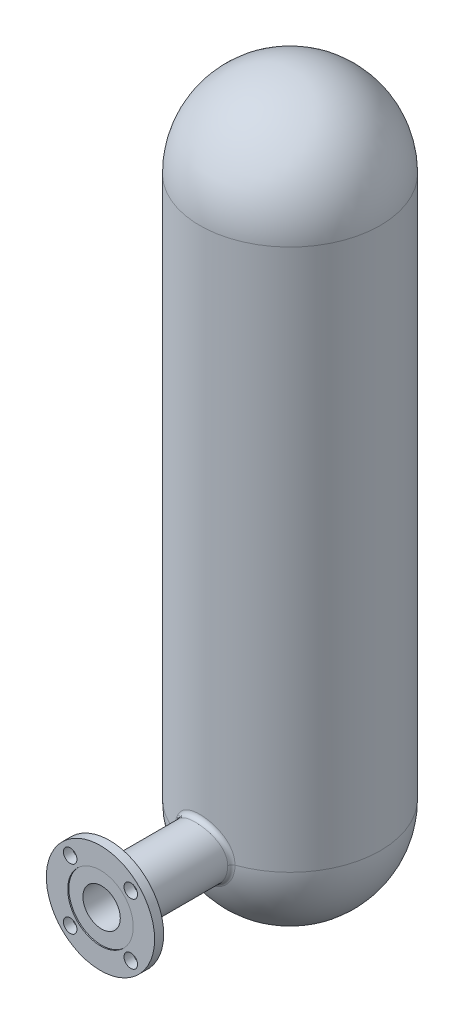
from build123d import *

# Parameters (mm, degrees)
SKETCH8_R          = 76.2
SKETCH8_R_2        = 9.525
SKETCH8_R_3        = 46.101
FLANGE_DEPTH       = 12.7
SKETCH8_3_R        = 9.525
MTG_HOLES_DEPTH    = 109.508847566
BOLT_PATTERN_COUNT = 4
SKETCH10_R         = 38.1
TAILPIECE_DEPTH    = 254
FILLET1_R          = 6.35
SKETCH16_R         = 26.289
CUT_EXTRUDE1_DEPTH = 127
SKETCH17_R         = 46.101
CUT_EXTRUDE2_DEPTH = 1.5875


with BuildPart() as part:
    # Sketch8 → Flange (new body)
    # profile 1 of 3: a face of its own
    with BuildSketch(Plane.XY):
        Circle(SKETCH8_R)
        with Locations((42.656216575, 42.656216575)):
            Circle(SKETCH8_R_2, mode=Mode.SUBTRACT)
        Circle(SKETCH8_R_3, mode=Mode.SUBTRACT)
    # profile 2 of 3: a face of its own
    with BuildSketch(Plane.XY):
        with Locations((42.656216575, 42.656216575)):
            Circle(SKETCH8_R_2)
    # profile 3 of 3: a face of its own
    with BuildSketch(Plane.XY):
        Circle(SKETCH8_R_3)
    extrude(amount=FLANGE_DEPTH)

    # Sketch8_3 → Mtg_Holes (cut, through all)
    with BuildSketch(Plane.XY):
        with Locations((42.656216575, 42.656216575)):
            Circle(SKETCH8_3_R)
    mtg_holes = extrude(amount=MTG_HOLES_DEPTH, mode=Mode.SUBTRACT)

    # Bolt_Pattern: Mtg_Holes ×4 about axis
    bolt_pattern_axis = Axis((0, 0, 0), (0, 0, 1))
    for i in range(1, BOLT_PATTERN_COUNT):
        add(mtg_holes.rotate(bolt_pattern_axis, i * 360 / BOLT_PATTERN_COUNT), mode=Mode.SUBTRACT)

    # Sketch10 → Tailpiece (add)
    with BuildSketch(Plane(origin=(0, 0, 0), x_dir=(-1, 0, 0), z_dir=(0, 0, -1))):
        with Locations(Location((0, 0, 0), (0, 0, 180))):
            Circle(SKETCH10_R)
    extrude(amount=TAILPIECE_DEPTH)

    # Sketch15 → Revolve1 (revolve)
    with BuildSketch(Plane(origin=(152.4, 0, -254), x_dir=(-1, 0, 0), z_dir=(0, 0, -1))):
        with BuildLine():
            Line((279.4, 762), (279.4, 0))
            ThreePointArc((279.4, 0), (242.202561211, -89.802561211), (152.4, -127))
            Line((152.4, -127), (152.4, 889))
            ThreePointArc((152.4, 889), (242.202561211, 851.802561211), (279.4, 762))
        make_face()
    revolve(axis=Axis((0, 381, -254), (0, 1, 0)))

    # Fillet1
    fillet1_edges = [part.edges().sort_by_distance(p)[0] for p in [
        (-38.1, 0, 0),
        (0, 38.099999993, -127),
        (0, -38.099999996, -132.84972142),
    ]]
    fillet(fillet1_edges, radius=FILLET1_R)

    # Sketch16 → Cut-Extrude1 (cut)
    with BuildSketch(Plane.XY.offset(12.7)):
        Circle(SKETCH16_R)
    extrude(amount=-CUT_EXTRUDE1_DEPTH, mode=Mode.SUBTRACT)

    # Sketch17 → Cut-Extrude2 (cut)
    with BuildSketch(Plane(origin=(-29.883533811, 10.746568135, 12.7), x_dir=(1, 0, 0), z_dir=(0, 0, 1))):
        with Locations((29.883533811, -10.746568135)):
            Circle(SKETCH17_R)
    extrude(amount=-CUT_EXTRUDE2_DEPTH, mode=Mode.SUBTRACT)


solid = part.part
